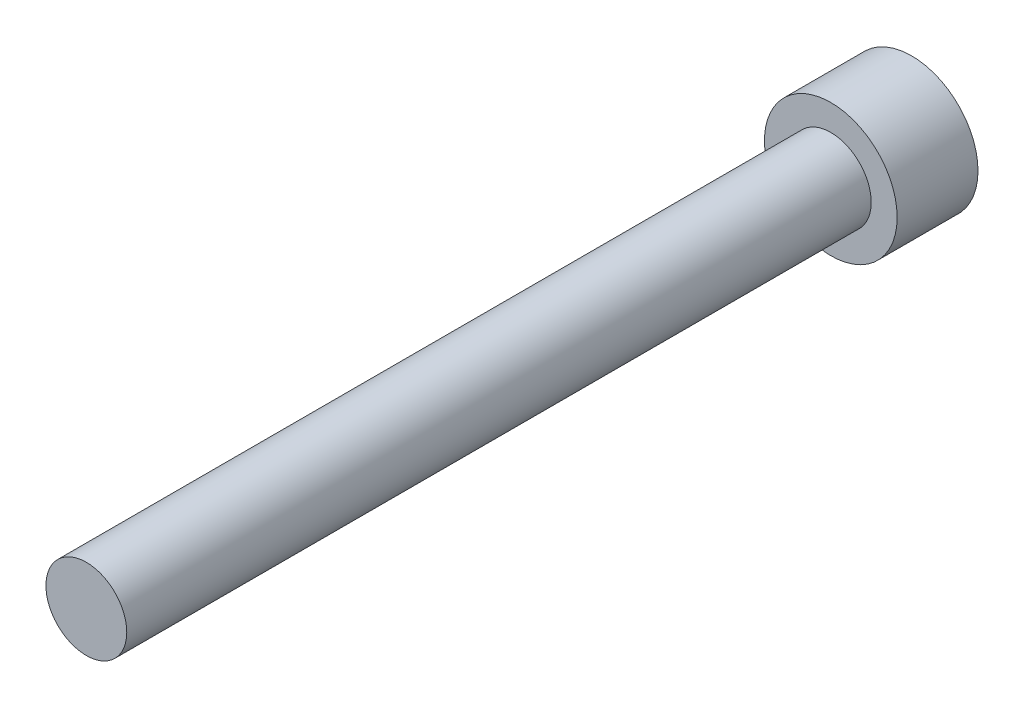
from build123d import *

# Parameters (mm, degrees)
HEX_2_DEPTH = 3.048


with BuildPart() as part:
    # Sketch6 → Revolve1 (revolve)
    with BuildSketch(Plane(origin=(0, 0, 0), x_dir=(0, 0, -1), z_dir=(1, 0, 0)), mode=Mode.PRIVATE) as revolve1_sk:
        Polygon((-44.45, 0), (-44.45, -2.413), (0, -2.413), (0, -3.9624), (4.826, -3.9624), (4.826, 0), align=None)
    revolve(revolve1_sk.sketch.rotate(Axis((0, 0, 44.45), (0, 0, -1)), 270), axis=Axis((0, 0, 44.45), (0, 0, -1)))

    # Sketch7 → HEX 2 (cut)
    with BuildSketch(Plane(origin=(0, 0, -4.826), x_dir=(-1, 0, 0), z_dir=(0, 0, -1))):
        Polygon((-1.9812, 1.143846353), (-1.9812, -1.143846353), (0, -2.287692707), (1.9812, -1.143846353), (1.9812, 1.143846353), (0, 2.287692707), align=None)
    extrude(amount=-HEX_2_DEPTH, mode=Mode.SUBTRACT)


solid = part.part
